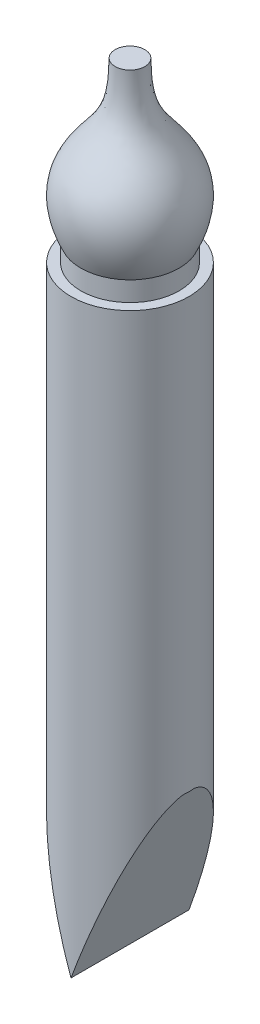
ISO-10303-21;
HEADER;
FILE_DESCRIPTION(('STEP AP214'),'2;1');
FILE_NAME('part.step','',(''),(''),'','','');
FILE_SCHEMA(('AUTOMOTIVE_DESIGN { 1 0 10303 214 1 1 1 1 }'));
ENDSEC;
DATA;
#1=APPLICATION_CONTEXT('core data for automotive mechanical design processes');
#2=APPLICATION_PROTOCOL_DEFINITION('international standard','automotive_design',2000,#1);
#3=PRODUCT_CONTEXT('',#1,'mechanical');
#4=PRODUCT('Part','Part','',(#3));
#5=PRODUCT_RELATED_PRODUCT_CATEGORY('part','',(#4));
#6=PRODUCT_DEFINITION_FORMATION('','',#4);
#7=PRODUCT_DEFINITION_CONTEXT('part definition',#1,'design');
#8=PRODUCT_DEFINITION('design','',#6,#7);
#9=PRODUCT_DEFINITION_SHAPE('','',#8);
#10=(LENGTH_UNIT() NAMED_UNIT(*) SI_UNIT(.MILLI.,.METRE.));
#11=(NAMED_UNIT(*) PLANE_ANGLE_UNIT() SI_UNIT($,.RADIAN.));
#12=(NAMED_UNIT(*) SI_UNIT($,.STERADIAN.) SOLID_ANGLE_UNIT());
#13=UNCERTAINTY_MEASURE_WITH_UNIT(LENGTH_MEASURE(1.E-05),#10,'distance_accuracy_value','');
#14=(GEOMETRIC_REPRESENTATION_CONTEXT(3) GLOBAL_UNCERTAINTY_ASSIGNED_CONTEXT((#13)) GLOBAL_UNIT_ASSIGNED_CONTEXT((#10,
#11,#12)) REPRESENTATION_CONTEXT('',''));
#15=CARTESIAN_POINT('',(0.,0.,0.));
#16=DIRECTION('',(0.,0.,1.));
#17=DIRECTION('',(1.,0.,0.));
#18=AXIS2_PLACEMENT_3D('',#15,#16,#17);
#19=CARTESIAN_POINT('',(0.,39.,0.));
#20=DIRECTION('',(0.,1.,0.));
#21=DIRECTION('',(0.,0.,1.));
#22=AXIS2_PLACEMENT_3D('',#19,#20,#21);
#23=CYLINDRICAL_SURFACE('',#22,3.);
#24=CARTESIAN_POINT('',(-2.98455592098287,8.2,0.30401637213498));
#25=DIRECTION('',(0.,0.,-1.));
#26=VECTOR('',#25,1.);
#27=LINE('',#24,#26);
#28=CARTESIAN_POINT('',(-2.98455592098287,8.2,0.304016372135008));
#29=VERTEX_POINT('',#28);
#30=CARTESIAN_POINT('',(-2.98455592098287,8.2,-0.30401637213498));
#31=VERTEX_POINT('',#30);
#32=EDGE_CURVE('E49',#29,#31,#27,.T.);
#33=ORIENTED_EDGE('',*,*,#32,.F.);
#34=CARTESIAN_POINT('',(0.,0.,0.));
#35=DIRECTION('',(-0.939692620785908,-0.34202014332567,0.));
#36=DIRECTION('',(-0.34202014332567,0.939692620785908,0.));
#37=AXIS2_PLACEMENT_3D('',#34,#35,#36);
#38=ELLIPSE('',#37,8.77141320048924,3.);
#39=CARTESIAN_POINT('',(0.,0.,3.));
#40=VERTEX_POINT('',#39);
#41=EDGE_CURVE('E79',#40,#29,#38,.T.);
#42=ORIENTED_EDGE('',*,*,#41,.F.);
#43=CARTESIAN_POINT('',(0.,0.,0.));
#44=DIRECTION('',(0.939692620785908,-0.34202014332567,0.));
#45=DIRECTION('',(0.34202014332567,0.939692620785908,0.));
#46=AXIS2_PLACEMENT_3D('',#43,#44,#45);
#47=ELLIPSE('',#46,8.77141320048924,3.);
#48=CARTESIAN_POINT('',(2.98455592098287,8.2,0.304016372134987));
#49=VERTEX_POINT('',#48);
#50=EDGE_CURVE('E55',#49,#40,#47,.T.);
#51=ORIENTED_EDGE('',*,*,#50,.F.);
#52=CARTESIAN_POINT('',(0.,8.2,0.));
#53=DIRECTION('',(0.,1.,0.));
#54=DIRECTION('',(0.994851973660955,0.,0.101338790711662));
#55=AXIS2_PLACEMENT_3D('',#52,#53,#54);
#56=CIRCLE('',#55,3.);
#57=CARTESIAN_POINT('',(2.98455592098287,8.2,-0.304016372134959));
#58=VERTEX_POINT('',#57);
#59=EDGE_CURVE('E65',#49,#58,#56,.T.);
#60=ORIENTED_EDGE('',*,*,#59,.T.);
#61=CARTESIAN_POINT('',(0.,0.,-3.));
#62=VERTEX_POINT('',#61);
#63=EDGE_CURVE('E69',#62,#58,#47,.T.);
#64=ORIENTED_EDGE('',*,*,#63,.F.);
#65=EDGE_CURVE('E92',#31,#62,#38,.T.);
#66=ORIENTED_EDGE('',*,*,#65,.F.);
#67=EDGE_LOOP('',(#33,#42,#51,#60,#64,#66));
#68=FACE_BOUND('',#67,.T.);
#69=CARTESIAN_POINT('',(0.,30.,0.));
#70=DIRECTION('',(0.,1.,0.));
#71=DIRECTION('',(0.,0.,1.));
#72=AXIS2_PLACEMENT_3D('',#69,#70,#71);
#73=CIRCLE('',#72,3.);
#74=CARTESIAN_POINT('',(0.,30.,3.));
#75=VERTEX_POINT('',#74);
#76=EDGE_CURVE('E134',#75,#75,#73,.T.);
#77=ORIENTED_EDGE('',*,*,#76,.F.);
#78=EDGE_LOOP('',(#77));
#79=FACE_BOUND('',#78,.T.);
#80=ADVANCED_FACE('F30',(#68,#79),#23,.T.);
#81=CARTESIAN_POINT('',(0.75,39.,0.));
#82=DIRECTION('',(0.,-1.,0.));
#83=DIRECTION('',(0.,0.,-1.));
#84=AXIS2_PLACEMENT_3D('',#81,#82,#83);
#85=PLANE('',#84);
#86=CARTESIAN_POINT('',(0.,39.,0.));
#87=DIRECTION('',(0.,1.,0.));
#88=DIRECTION('',(0.,0.,1.));
#89=AXIS2_PLACEMENT_3D('',#86,#87,#88);
#90=CIRCLE('',#89,0.75);
#91=CARTESIAN_POINT('',(0.,39.,0.75));
#92=VERTEX_POINT('',#91);
#93=EDGE_CURVE('E11',#92,#92,#90,.T.);
#94=ORIENTED_EDGE('',*,*,#93,.T.);
#95=EDGE_LOOP('',(#94));
#96=FACE_BOUND('',#95,.T.);
#97=ADVANCED_FACE('F32',(#96),#85,.F.);
#98=CARTESIAN_POINT('',(2.49999999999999,31.,0.));
#99=CARTESIAN_POINT('',(3.62216646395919,33.3621251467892,0.));
#100=CARTESIAN_POINT('',(1.62304376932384,35.871683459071,0.));
#101=CARTESIAN_POINT('',(0.75,36.9949117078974,0.));
#102=CARTESIAN_POINT('',(0.75,39.,0.));
#103=B_SPLINE_CURVE_WITH_KNOTS('',3,(#98,#99,#100,#101,#102),.UNSPECIFIED.,.F.,.F.,(4,1,4),(0.,
0.508286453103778,1.),.UNSPECIFIED.);
#104=CARTESIAN_POINT('',(0.,39.,0.));
#105=DIRECTION('',(0.,1.,0.));
#106=AXIS1_PLACEMENT('',#104,#105);
#107=SURFACE_OF_REVOLUTION('',#103,#106);
#108=ORIENTED_EDGE('',*,*,#93,.F.);
#109=EDGE_LOOP('',(#108));
#110=FACE_BOUND('',#109,.T.);
#111=CARTESIAN_POINT('',(0.,31.,0.));
#112=DIRECTION('',(0.,1.,0.));
#113=DIRECTION('',(0.,0.,1.));
#114=AXIS2_PLACEMENT_3D('',#111,#112,#113);
#115=CIRCLE('',#114,2.5);
#116=CARTESIAN_POINT('',(0.,31.,2.5));
#117=VERTEX_POINT('',#116);
#118=EDGE_CURVE('E41',#117,#117,#115,.T.);
#119=ORIENTED_EDGE('',*,*,#118,.T.);
#120=EDGE_LOOP('',(#119));
#121=FACE_BOUND('',#120,.T.);
#122=ADVANCED_FACE('F126',(#110,#121),#107,.T.);
#123=CARTESIAN_POINT('',(0.,39.,0.));
#124=DIRECTION('',(0.,1.,0.));
#125=DIRECTION('',(0.,0.,1.));
#126=AXIS2_PLACEMENT_3D('',#123,#124,#125);
#127=CYLINDRICAL_SURFACE('',#126,2.5);
#128=ORIENTED_EDGE('',*,*,#118,.F.);
#129=EDGE_LOOP('',(#128));
#130=FACE_BOUND('',#129,.T.);
#131=CARTESIAN_POINT('',(0.,30.,0.));
#132=DIRECTION('',(0.,1.,0.));
#133=DIRECTION('',(0.,0.,1.));
#134=AXIS2_PLACEMENT_3D('',#131,#132,#133);
#135=CIRCLE('',#134,2.5);
#136=CARTESIAN_POINT('',(0.,30.,2.5));
#137=VERTEX_POINT('',#136);
#138=EDGE_CURVE('E140',#137,#137,#135,.T.);
#139=ORIENTED_EDGE('',*,*,#138,.T.);
#140=EDGE_LOOP('',(#139));
#141=FACE_BOUND('',#140,.T.);
#142=ADVANCED_FACE('F123',(#130,#141),#127,.T.);
#143=CARTESIAN_POINT('',(3.,30.,0.));
#144=DIRECTION('',(0.,-1.,0.));
#145=DIRECTION('',(0.,0.,-1.));
#146=AXIS2_PLACEMENT_3D('',#143,#144,#145);
#147=PLANE('',#146);
#148=ORIENTED_EDGE('',*,*,#138,.F.);
#149=EDGE_LOOP('',(#148));
#150=FACE_BOUND('',#149,.T.);
#151=ORIENTED_EDGE('',*,*,#76,.T.);
#152=EDGE_LOOP('',(#151));
#153=FACE_BOUND('',#152,.T.);
#154=ADVANCED_FACE('F107',(#150,#153),#147,.F.);
#155=CARTESIAN_POINT('',(0.,0.,51.3415040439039));
#156=DIRECTION('',(-0.939692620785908,-0.34202014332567,0.));
#157=DIRECTION('',(0.34202014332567,-0.939692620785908,0.));
#158=AXIS2_PLACEMENT_3D('',#155,#156,#157);
#159=PLANE('',#158);
#160=ORIENTED_EDGE('',*,*,#32,.T.);
#161=ORIENTED_EDGE('',*,*,#65,.T.);
#162=DIRECTION('',(0.,0.,-1.));
#163=VECTOR('',#162,1.);
#164=CARTESIAN_POINT('',(0.,0.,51.3415040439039));
#165=LINE('',#164,#163);
#166=EDGE_CURVE('E73',#40,#62,#165,.T.);
#167=ORIENTED_EDGE('',*,*,#166,.F.);
#168=ORIENTED_EDGE('',*,*,#41,.T.);
#169=EDGE_LOOP('',(#160,#161,#167,#168));
#170=FACE_BOUND('',#169,.T.);
#171=ADVANCED_FACE('F98',(#170),#159,.T.);
#172=CARTESIAN_POINT('',(0.,0.,51.3415040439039));
#173=DIRECTION('',(0.939692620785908,-0.34202014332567,0.));
#174=DIRECTION('',(0.34202014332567,0.939692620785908,0.));
#175=AXIS2_PLACEMENT_3D('',#172,#173,#174);
#176=PLANE('',#175);
#177=ORIENTED_EDGE('',*,*,#59,.F.);
#178=ORIENTED_EDGE('',*,*,#50,.T.);
#179=ORIENTED_EDGE('',*,*,#166,.T.);
#180=ORIENTED_EDGE('',*,*,#63,.T.);
#181=EDGE_LOOP('',(#177,#178,#179,#180));
#182=FACE_BOUND('',#181,.T.);
#183=ADVANCED_FACE('F76',(#182),#176,.T.);
#184=CLOSED_SHELL('',(#80,#97,#122,#142,#154,#171,#183));
#185=MANIFOLD_SOLID_BREP('B2',#184);
#186=ADVANCED_BREP_SHAPE_REPRESENTATION('',(#18,#185),#14);
#187=SHAPE_DEFINITION_REPRESENTATION(#9,#186);
ENDSEC;
END-ISO-10303-21;
